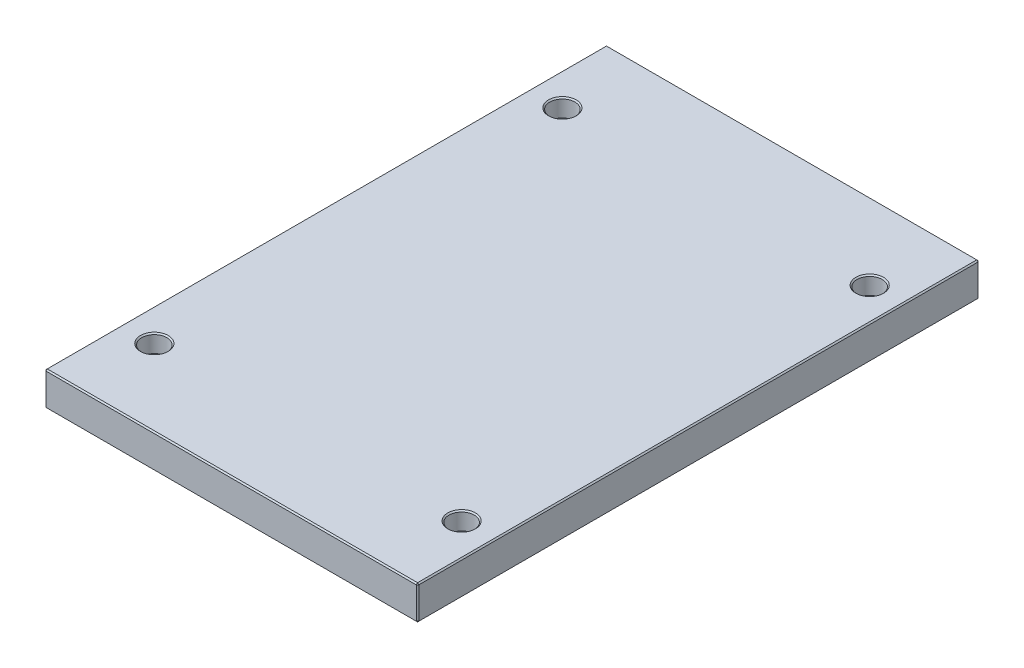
ISO-10303-21;
HEADER;
FILE_DESCRIPTION(('STEP AP214'),'2;1');
FILE_NAME('part.step','',(''),(''),'','','');
FILE_SCHEMA(('AUTOMOTIVE_DESIGN { 1 0 10303 214 1 1 1 1 }'));
ENDSEC;
DATA;
#1=APPLICATION_CONTEXT('core data for automotive mechanical design processes');
#2=APPLICATION_PROTOCOL_DEFINITION('international standard','automotive_design',2000,#1);
#3=PRODUCT_CONTEXT('',#1,'mechanical');
#4=PRODUCT('Part','Part','',(#3));
#5=PRODUCT_RELATED_PRODUCT_CATEGORY('part','',(#4));
#6=PRODUCT_DEFINITION_FORMATION('','',#4);
#7=PRODUCT_DEFINITION_CONTEXT('part definition',#1,'design');
#8=PRODUCT_DEFINITION('design','',#6,#7);
#9=PRODUCT_DEFINITION_SHAPE('','',#8);
#10=(LENGTH_UNIT() NAMED_UNIT(*) SI_UNIT(.MILLI.,.METRE.));
#11=(NAMED_UNIT(*) PLANE_ANGLE_UNIT() SI_UNIT($,.RADIAN.));
#12=(NAMED_UNIT(*) SI_UNIT($,.STERADIAN.) SOLID_ANGLE_UNIT());
#13=UNCERTAINTY_MEASURE_WITH_UNIT(LENGTH_MEASURE(1.E-05),#10,'distance_accuracy_value','');
#14=(GEOMETRIC_REPRESENTATION_CONTEXT(3) GLOBAL_UNCERTAINTY_ASSIGNED_CONTEXT((#13)) GLOBAL_UNIT_ASSIGNED_CONTEXT((#10,
#11,#12)) REPRESENTATION_CONTEXT('',''));
#15=CARTESIAN_POINT('',(0.,0.,0.));
#16=DIRECTION('',(0.,0.,1.));
#17=DIRECTION('',(1.,0.,0.));
#18=AXIS2_PLACEMENT_3D('',#15,#16,#17);
#19=CARTESIAN_POINT('',(-148.,27.,223.));
#20=DIRECTION('',(1.,0.,0.));
#21=DIRECTION('',(0.,0.,-1.));
#22=AXIS2_PLACEMENT_3D('',#19,#20,#21);
#23=PLANE('',#22);
#24=DIRECTION('',(0.,-1.,0.));
#25=VECTOR('',#24,1.);
#26=CARTESIAN_POINT('',(-148.,27.,-222.));
#27=LINE('',#26,#25);
#28=CARTESIAN_POINT('',(-148.,26.,-222.));
#29=VERTEX_POINT('',#28);
#30=CARTESIAN_POINT('',(-148.,1.,-222.));
#31=VERTEX_POINT('',#30);
#32=EDGE_CURVE('E115',#29,#31,#27,.T.);
#33=ORIENTED_EDGE('',*,*,#32,.T.);
#34=DIRECTION('',(0.,0.,1.));
#35=VECTOR('',#34,1.);
#36=CARTESIAN_POINT('',(-148.,1.,223.));
#37=LINE('',#36,#35);
#38=CARTESIAN_POINT('',(-148.,1.,222.));
#39=VERTEX_POINT('',#38);
#40=EDGE_CURVE('E111',#31,#39,#37,.T.);
#41=ORIENTED_EDGE('',*,*,#40,.T.);
#42=DIRECTION('',(0.,1.,0.));
#43=VECTOR('',#42,1.);
#44=CARTESIAN_POINT('',(-148.,27.,222.));
#45=LINE('',#44,#43);
#46=CARTESIAN_POINT('',(-148.,26.,222.));
#47=VERTEX_POINT('',#46);
#48=EDGE_CURVE('E104',#39,#47,#45,.T.);
#49=ORIENTED_EDGE('',*,*,#48,.T.);
#50=DIRECTION('',(0.,0.,-1.));
#51=VECTOR('',#50,1.);
#52=CARTESIAN_POINT('',(-148.,26.,-223.));
#53=LINE('',#52,#51);
#54=EDGE_CURVE('E108',#47,#29,#53,.T.);
#55=ORIENTED_EDGE('',*,*,#54,.T.);
#56=EDGE_LOOP('',(#33,#41,#49,#55));
#57=FACE_BOUND('',#56,.T.);
#58=ADVANCED_FACE('F16',(#57),#23,.F.);
#59=CARTESIAN_POINT('',(148.,27.,223.));
#60=DIRECTION('',(0.,0.,-1.));
#61=DIRECTION('',(-1.,0.,0.));
#62=AXIS2_PLACEMENT_3D('',#59,#60,#61);
#63=PLANE('',#62);
#64=DIRECTION('',(-1.,0.,0.));
#65=VECTOR('',#64,1.);
#66=CARTESIAN_POINT('',(-148.,26.,223.));
#67=LINE('',#66,#65);
#68=CARTESIAN_POINT('',(147.,26.,223.));
#69=VERTEX_POINT('',#68);
#70=CARTESIAN_POINT('',(-147.,26.,223.));
#71=VERTEX_POINT('',#70);
#72=EDGE_CURVE('E170',#69,#71,#67,.T.);
#73=ORIENTED_EDGE('',*,*,#72,.T.);
#74=DIRECTION('',(0.,-1.,0.));
#75=VECTOR('',#74,1.);
#76=CARTESIAN_POINT('',(-147.,27.,223.));
#77=LINE('',#76,#75);
#78=CARTESIAN_POINT('',(-147.,0.999999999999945,223.));
#79=VERTEX_POINT('',#78);
#80=EDGE_CURVE('E123',#71,#79,#77,.T.);
#81=ORIENTED_EDGE('',*,*,#80,.T.);
#82=DIRECTION('',(1.,0.,0.));
#83=VECTOR('',#82,1.);
#84=CARTESIAN_POINT('',(148.,0.999999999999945,223.));
#85=LINE('',#84,#83);
#86=CARTESIAN_POINT('',(147.,0.999999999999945,223.));
#87=VERTEX_POINT('',#86);
#88=EDGE_CURVE('E174',#79,#87,#85,.T.);
#89=ORIENTED_EDGE('',*,*,#88,.T.);
#90=DIRECTION('',(0.,1.,0.));
#91=VECTOR('',#90,1.);
#92=CARTESIAN_POINT('',(147.,27.,223.));
#93=LINE('',#92,#91);
#94=EDGE_CURVE('E172',#87,#69,#93,.T.);
#95=ORIENTED_EDGE('',*,*,#94,.T.);
#96=EDGE_LOOP('',(#73,#81,#89,#95));
#97=FACE_BOUND('',#96,.T.);
#98=ADVANCED_FACE('F317',(#97),#63,.F.);
#99=CARTESIAN_POINT('',(148.,27.,223.));
#100=DIRECTION('',(-1.,0.,0.));
#101=DIRECTION('',(0.,0.,1.));
#102=AXIS2_PLACEMENT_3D('',#99,#100,#101);
#103=PLANE('',#102);
#104=DIRECTION('',(0.,0.,-1.));
#105=VECTOR('',#104,1.);
#106=CARTESIAN_POINT('',(148.,0.999999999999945,223.));
#107=LINE('',#106,#105);
#108=CARTESIAN_POINT('',(148.,0.999999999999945,222.));
#109=VERTEX_POINT('',#108);
#110=CARTESIAN_POINT('',(148.,0.999999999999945,-222.));
#111=VERTEX_POINT('',#110);
#112=EDGE_CURVE('E165',#109,#111,#107,.T.);
#113=ORIENTED_EDGE('',*,*,#112,.T.);
#114=DIRECTION('',(0.,1.,0.));
#115=VECTOR('',#114,1.);
#116=CARTESIAN_POINT('',(148.,27.,-222.));
#117=LINE('',#116,#115);
#118=CARTESIAN_POINT('',(148.,26.,-222.));
#119=VERTEX_POINT('',#118);
#120=EDGE_CURVE('E167',#111,#119,#117,.T.);
#121=ORIENTED_EDGE('',*,*,#120,.T.);
#122=DIRECTION('',(0.,0.,1.));
#123=VECTOR('',#122,1.);
#124=CARTESIAN_POINT('',(148.,26.,223.));
#125=LINE('',#124,#123);
#126=CARTESIAN_POINT('',(148.,26.,222.));
#127=VERTEX_POINT('',#126);
#128=EDGE_CURVE('E161',#119,#127,#125,.T.);
#129=ORIENTED_EDGE('',*,*,#128,.T.);
#130=DIRECTION('',(0.,-1.,0.));
#131=VECTOR('',#130,1.);
#132=CARTESIAN_POINT('',(148.,27.,222.));
#133=LINE('',#132,#131);
#134=EDGE_CURVE('E163',#127,#109,#133,.T.);
#135=ORIENTED_EDGE('',*,*,#134,.T.);
#136=EDGE_LOOP('',(#113,#121,#129,#135));
#137=FACE_BOUND('',#136,.T.);
#138=ADVANCED_FACE('F323',(#137),#103,.F.);
#139=CARTESIAN_POINT('',(148.,27.,-223.));
#140=DIRECTION('',(0.,0.,1.));
#141=DIRECTION('',(1.,0.,0.));
#142=AXIS2_PLACEMENT_3D('',#139,#140,#141);
#143=PLANE('',#142);
#144=DIRECTION('',(0.,-1.,0.));
#145=VECTOR('',#144,1.);
#146=CARTESIAN_POINT('',(147.,27.,-223.));
#147=LINE('',#146,#145);
#148=CARTESIAN_POINT('',(147.,26.,-223.));
#149=VERTEX_POINT('',#148);
#150=CARTESIAN_POINT('',(147.,0.999999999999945,-223.));
#151=VERTEX_POINT('',#150);
#152=EDGE_CURVE('E154',#149,#151,#147,.T.);
#153=ORIENTED_EDGE('',*,*,#152,.T.);
#154=DIRECTION('',(-1.,0.,0.));
#155=VECTOR('',#154,1.);
#156=CARTESIAN_POINT('',(148.,0.999999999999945,-223.));
#157=LINE('',#156,#155);
#158=CARTESIAN_POINT('',(-147.,0.999999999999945,-223.));
#159=VERTEX_POINT('',#158);
#160=EDGE_CURVE('E159',#151,#159,#157,.T.);
#161=ORIENTED_EDGE('',*,*,#160,.T.);
#162=DIRECTION('',(0.,1.,0.));
#163=VECTOR('',#162,1.);
#164=CARTESIAN_POINT('',(-147.,27.,-223.));
#165=LINE('',#164,#163);
#166=CARTESIAN_POINT('',(-147.,26.,-223.));
#167=VERTEX_POINT('',#166);
#168=EDGE_CURVE('E156',#159,#167,#165,.T.);
#169=ORIENTED_EDGE('',*,*,#168,.T.);
#170=DIRECTION('',(1.,0.,0.));
#171=VECTOR('',#170,1.);
#172=CARTESIAN_POINT('',(148.,26.,-223.));
#173=LINE('',#172,#171);
#174=EDGE_CURVE('E152',#167,#149,#173,.T.);
#175=ORIENTED_EDGE('',*,*,#174,.T.);
#176=EDGE_LOOP('',(#153,#161,#169,#175));
#177=FACE_BOUND('',#176,.T.);
#178=ADVANCED_FACE('F465',(#177),#143,.F.);
#179=CARTESIAN_POINT('',(0.,27.,0.));
#180=DIRECTION('',(0.,1.,0.));
#181=DIRECTION('',(0.,0.,1.));
#182=AXIS2_PLACEMENT_3D('',#179,#180,#181);
#183=PLANE('',#182);
#184=CARTESIAN_POINT('',(-122.,27.,162.));
#185=DIRECTION('',(0.,1.,0.));
#186=DIRECTION('',(0.,0.,1.));
#187=AXIS2_PLACEMENT_3D('',#184,#185,#186);
#188=CIRCLE('',#187,11.);
#189=CARTESIAN_POINT('',(-122.,27.,173.));
#190=VERTEX_POINT('',#189);
#191=EDGE_CURVE('E290',#190,#190,#188,.F.);
#192=ORIENTED_EDGE('',*,*,#191,.T.);
#193=EDGE_LOOP('',(#192));
#194=FACE_BOUND('',#193,.T.);
#195=CARTESIAN_POINT('',(122.,27.,162.));
#196=DIRECTION('',(0.,1.,0.));
#197=DIRECTION('',(0.,0.,1.));
#198=AXIS2_PLACEMENT_3D('',#195,#196,#197);
#199=CIRCLE('',#198,11.);
#200=CARTESIAN_POINT('',(122.,27.,173.));
#201=VERTEX_POINT('',#200);
#202=EDGE_CURVE('E287',#201,#201,#199,.F.);
#203=ORIENTED_EDGE('',*,*,#202,.T.);
#204=EDGE_LOOP('',(#203));
#205=FACE_BOUND('',#204,.T.);
#206=CARTESIAN_POINT('',(122.,27.,-162.));
#207=DIRECTION('',(0.,1.,0.));
#208=DIRECTION('',(0.,0.,1.));
#209=AXIS2_PLACEMENT_3D('',#206,#207,#208);
#210=CIRCLE('',#209,11.);
#211=CARTESIAN_POINT('',(122.,27.,-151.));
#212=VERTEX_POINT('',#211);
#213=EDGE_CURVE('E284',#212,#212,#210,.F.);
#214=ORIENTED_EDGE('',*,*,#213,.T.);
#215=EDGE_LOOP('',(#214));
#216=FACE_BOUND('',#215,.T.);
#217=CARTESIAN_POINT('',(-122.,27.,-162.));
#218=DIRECTION('',(0.,1.,0.));
#219=DIRECTION('',(0.,0.,1.));
#220=AXIS2_PLACEMENT_3D('',#217,#218,#219);
#221=CIRCLE('',#220,11.);
#222=CARTESIAN_POINT('',(-122.,27.,-151.));
#223=VERTEX_POINT('',#222);
#224=EDGE_CURVE('E281',#223,#223,#221,.F.);
#225=ORIENTED_EDGE('',*,*,#224,.T.);
#226=EDGE_LOOP('',(#225));
#227=FACE_BOUND('',#226,.T.);
#228=DIRECTION('',(0.,0.,-1.));
#229=VECTOR('',#228,1.);
#230=CARTESIAN_POINT('',(147.,27.,-223.));
#231=LINE('',#230,#229);
#232=CARTESIAN_POINT('',(147.,27.,222.));
#233=VERTEX_POINT('',#232);
#234=CARTESIAN_POINT('',(147.,27.,-222.));
#235=VERTEX_POINT('',#234);
#236=EDGE_CURVE('E31',#233,#235,#231,.T.);
#237=ORIENTED_EDGE('',*,*,#236,.T.);
#238=DIRECTION('',(-1.,0.,0.));
#239=VECTOR('',#238,1.);
#240=CARTESIAN_POINT('',(-148.,27.,-222.));
#241=LINE('',#240,#239);
#242=CARTESIAN_POINT('',(-147.,27.,-222.));
#243=VERTEX_POINT('',#242);
#244=EDGE_CURVE('E190',#235,#243,#241,.T.);
#245=ORIENTED_EDGE('',*,*,#244,.T.);
#246=DIRECTION('',(0.,0.,1.));
#247=VECTOR('',#246,1.);
#248=CARTESIAN_POINT('',(-147.,27.,223.));
#249=LINE('',#248,#247);
#250=CARTESIAN_POINT('',(-147.,27.,222.));
#251=VERTEX_POINT('',#250);
#252=EDGE_CURVE('E186',#243,#251,#249,.T.);
#253=ORIENTED_EDGE('',*,*,#252,.T.);
#254=DIRECTION('',(1.,0.,0.));
#255=VECTOR('',#254,1.);
#256=CARTESIAN_POINT('',(148.,27.,222.));
#257=LINE('',#256,#255);
#258=EDGE_CURVE('E36',#251,#233,#257,.T.);
#259=ORIENTED_EDGE('',*,*,#258,.T.);
#260=EDGE_LOOP('',(#237,#245,#253,#259));
#261=FACE_BOUND('',#260,.T.);
#262=ADVANCED_FACE('F462',(#194,#205,#216,#227,#261),#183,.T.);
#263=CARTESIAN_POINT('',(0.,0.,0.));
#264=DIRECTION('',(0.,1.,0.));
#265=DIRECTION('',(0.,0.,1.));
#266=AXIS2_PLACEMENT_3D('',#263,#264,#265);
#267=PLANE('',#266);
#268=CARTESIAN_POINT('',(122.,0.,-162.));
#269=DIRECTION('',(0.,1.,0.));
#270=DIRECTION('',(0.,0.,1.));
#271=AXIS2_PLACEMENT_3D('',#268,#269,#270);
#272=CIRCLE('',#271,7.9999999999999);
#273=CARTESIAN_POINT('',(122.,0.,-154.));
#274=VERTEX_POINT('',#273);
#275=EDGE_CURVE('E263',#274,#274,#272,.T.);
#276=ORIENTED_EDGE('',*,*,#275,.T.);
#277=EDGE_LOOP('',(#276));
#278=FACE_BOUND('',#277,.T.);
#279=CARTESIAN_POINT('',(122.,0.,162.));
#280=DIRECTION('',(0.,1.,0.));
#281=DIRECTION('',(0.,0.,1.));
#282=AXIS2_PLACEMENT_3D('',#279,#280,#281);
#283=CIRCLE('',#282,7.9999999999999);
#284=CARTESIAN_POINT('',(122.,0.,170.));
#285=VERTEX_POINT('',#284);
#286=EDGE_CURVE('E260',#285,#285,#283,.T.);
#287=ORIENTED_EDGE('',*,*,#286,.T.);
#288=EDGE_LOOP('',(#287));
#289=FACE_BOUND('',#288,.T.);
#290=CARTESIAN_POINT('',(-122.,0.,162.));
#291=DIRECTION('',(0.,1.,0.));
#292=DIRECTION('',(0.,0.,1.));
#293=AXIS2_PLACEMENT_3D('',#290,#291,#292);
#294=CIRCLE('',#293,7.9999999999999);
#295=CARTESIAN_POINT('',(-122.,0.,170.));
#296=VERTEX_POINT('',#295);
#297=EDGE_CURVE('E257',#296,#296,#294,.T.);
#298=ORIENTED_EDGE('',*,*,#297,.T.);
#299=EDGE_LOOP('',(#298));
#300=FACE_BOUND('',#299,.T.);
#301=CARTESIAN_POINT('',(-122.,0.,-162.));
#302=DIRECTION('',(0.,1.,0.));
#303=DIRECTION('',(0.,0.,1.));
#304=AXIS2_PLACEMENT_3D('',#301,#302,#303);
#305=CIRCLE('',#304,7.9999999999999);
#306=CARTESIAN_POINT('',(-122.,0.,-154.));
#307=VERTEX_POINT('',#306);
#308=EDGE_CURVE('E192',#307,#307,#305,.T.);
#309=ORIENTED_EDGE('',*,*,#308,.T.);
#310=EDGE_LOOP('',(#309));
#311=FACE_BOUND('',#310,.T.);
#312=DIRECTION('',(0.,0.,1.));
#313=VECTOR('',#312,1.);
#314=CARTESIAN_POINT('',(147.,0.,0.));
#315=LINE('',#314,#313);
#316=CARTESIAN_POINT('',(147.,0.,-222.));
#317=VERTEX_POINT('',#316);
#318=CARTESIAN_POINT('',(147.,0.,222.));
#319=VERTEX_POINT('',#318);
#320=EDGE_CURVE('E177',#317,#319,#315,.T.);
#321=ORIENTED_EDGE('',*,*,#320,.T.);
#322=DIRECTION('',(-1.,0.,0.));
#323=VECTOR('',#322,1.);
#324=CARTESIAN_POINT('',(0.,0.,222.));
#325=LINE('',#324,#323);
#326=CARTESIAN_POINT('',(-147.,0.,222.));
#327=VERTEX_POINT('',#326);
#328=EDGE_CURVE('E183',#319,#327,#325,.T.);
#329=ORIENTED_EDGE('',*,*,#328,.T.);
#330=DIRECTION('',(0.,0.,-1.));
#331=VECTOR('',#330,1.);
#332=CARTESIAN_POINT('',(-147.,0.,0.));
#333=LINE('',#332,#331);
#334=CARTESIAN_POINT('',(-147.,0.,-222.));
#335=VERTEX_POINT('',#334);
#336=EDGE_CURVE('E181',#327,#335,#333,.T.);
#337=ORIENTED_EDGE('',*,*,#336,.T.);
#338=DIRECTION('',(1.,0.,0.));
#339=VECTOR('',#338,1.);
#340=CARTESIAN_POINT('',(0.,0.,-222.));
#341=LINE('',#340,#339);
#342=EDGE_CURVE('E179',#335,#317,#341,.T.);
#343=ORIENTED_EDGE('',*,*,#342,.T.);
#344=EDGE_LOOP('',(#321,#329,#337,#343));
#345=FACE_BOUND('',#344,.T.);
#346=ADVANCED_FACE('F402',(#278,#289,#300,#311,#345),#267,.F.);
#347=CARTESIAN_POINT('',(148.,27.,222.));
#348=DIRECTION('',(-0.707106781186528,0.,-0.707106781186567));
#349=DIRECTION('',(0.,-1.,0.));
#350=AXIS2_PLACEMENT_3D('',#347,#348,#349);
#351=PLANE('',#350);
#352=DIRECTION('',(-0.707106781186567,0.,0.707106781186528));
#353=VECTOR('',#352,1.);
#354=CARTESIAN_POINT('',(147.,26.,223.));
#355=LINE('',#354,#353);
#356=EDGE_CURVE('E141',#69,#127,#355,.F.);
#357=ORIENTED_EDGE('',*,*,#356,.F.);
#358=ORIENTED_EDGE('',*,*,#94,.F.);
#359=DIRECTION('',(0.707106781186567,0.,-0.707106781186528));
#360=VECTOR('',#359,1.);
#361=CARTESIAN_POINT('',(147.,0.999999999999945,223.));
#362=LINE('',#361,#360);
#363=EDGE_CURVE('E144',#109,#87,#362,.F.);
#364=ORIENTED_EDGE('',*,*,#363,.F.);
#365=ORIENTED_EDGE('',*,*,#134,.F.);
#366=EDGE_LOOP('',(#357,#358,#364,#365));
#367=FACE_BOUND('',#366,.T.);
#368=ADVANCED_FACE('F398',(#367),#351,.F.);
#369=CARTESIAN_POINT('',(147.,26.,223.));
#370=DIRECTION('',(0.577350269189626,0.577350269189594,0.577350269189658));
#371=DIRECTION('',(0.707106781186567,0.,-0.707106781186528));
#372=AXIS2_PLACEMENT_3D('',#369,#370,#371);
#373=PLANE('',#372);
#374=DIRECTION('',(0.,-0.707106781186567,0.707106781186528));
#375=VECTOR('',#374,1.);
#376=CARTESIAN_POINT('',(147.,26.,223.));
#377=LINE('',#376,#375);
#378=EDGE_CURVE('E235',#69,#233,#377,.F.);
#379=ORIENTED_EDGE('',*,*,#378,.F.);
#380=ORIENTED_EDGE('',*,*,#356,.T.);
#381=DIRECTION('',(-0.707106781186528,0.707106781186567,0.));
#382=VECTOR('',#381,1.);
#383=CARTESIAN_POINT('',(147.5,26.5,222.));
#384=LINE('',#383,#382);
#385=EDGE_CURVE('E237',#233,#127,#384,.F.);
#386=ORIENTED_EDGE('',*,*,#385,.F.);
#387=EDGE_LOOP('',(#379,#380,#386));
#388=FACE_BOUND('',#387,.T.);
#389=ADVANCED_FACE('F394',(#388),#373,.T.);
#390=CARTESIAN_POINT('',(147.,0.999999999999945,223.));
#391=DIRECTION('',(0.577350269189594,-0.577350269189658,0.577350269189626));
#392=DIRECTION('',(0.,-0.707106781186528,-0.707106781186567));
#393=AXIS2_PLACEMENT_3D('',#390,#391,#392);
#394=PLANE('',#393);
#395=DIRECTION('',(-0.707106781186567,-0.707106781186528,0.));
#396=VECTOR('',#395,1.);
#397=CARTESIAN_POINT('',(147.5,0.499999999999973,222.));
#398=LINE('',#397,#396);
#399=EDGE_CURVE('E229',#109,#319,#398,.T.);
#400=ORIENTED_EDGE('',*,*,#399,.F.);
#401=ORIENTED_EDGE('',*,*,#363,.T.);
#402=DIRECTION('',(0.,0.707106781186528,0.707106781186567));
#403=VECTOR('',#402,1.);
#404=CARTESIAN_POINT('',(147.,0.999999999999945,223.));
#405=LINE('',#404,#403);
#406=EDGE_CURVE('E232',#319,#87,#405,.T.);
#407=ORIENTED_EDGE('',*,*,#406,.F.);
#408=EDGE_LOOP('',(#400,#401,#407));
#409=FACE_BOUND('',#408,.T.);
#410=ADVANCED_FACE('F390',(#409),#394,.T.);
#411=CARTESIAN_POINT('',(147.,27.,0.));
#412=DIRECTION('',(0.707106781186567,0.707106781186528,0.));
#413=DIRECTION('',(0.,0.,1.));
#414=AXIS2_PLACEMENT_3D('',#411,#412,#413);
#415=PLANE('',#414);
#416=ORIENTED_EDGE('',*,*,#385,.T.);
#417=ORIENTED_EDGE('',*,*,#128,.F.);
#418=DIRECTION('',(0.707106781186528,-0.707106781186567,0.));
#419=VECTOR('',#418,1.);
#420=CARTESIAN_POINT('',(148.,26.,-222.));
#421=LINE('',#420,#419);
#422=EDGE_CURVE('E224',#235,#119,#421,.T.);
#423=ORIENTED_EDGE('',*,*,#422,.F.);
#424=ORIENTED_EDGE('',*,*,#236,.F.);
#425=EDGE_LOOP('',(#416,#417,#423,#424));
#426=FACE_BOUND('',#425,.T.);
#427=ADVANCED_FACE('F386',(#426),#415,.T.);
#428=CARTESIAN_POINT('',(0.,27.,222.));
#429=DIRECTION('',(0.,0.707106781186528,0.707106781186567));
#430=DIRECTION('',(-1.,0.,0.));
#431=AXIS2_PLACEMENT_3D('',#428,#429,#430);
#432=PLANE('',#431);
#433=ORIENTED_EDGE('',*,*,#378,.T.);
#434=ORIENTED_EDGE('',*,*,#258,.F.);
#435=DIRECTION('',(0.,0.707106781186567,-0.707106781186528));
#436=VECTOR('',#435,1.);
#437=CARTESIAN_POINT('',(-147.,26.5,222.5));
#438=LINE('',#437,#436);
#439=EDGE_CURVE('E127',#71,#251,#438,.T.);
#440=ORIENTED_EDGE('',*,*,#439,.F.);
#441=ORIENTED_EDGE('',*,*,#72,.F.);
#442=EDGE_LOOP('',(#433,#434,#440,#441));
#443=FACE_BOUND('',#442,.T.);
#444=ADVANCED_FACE('F383',(#443),#432,.T.);
#445=CARTESIAN_POINT('',(-147.,27.,223.));
#446=DIRECTION('',(0.707106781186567,0.,-0.707106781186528));
#447=DIRECTION('',(0.,-1.,0.));
#448=AXIS2_PLACEMENT_3D('',#445,#446,#447);
#449=PLANE('',#448);
#450=DIRECTION('',(0.707106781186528,0.,0.707106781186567));
#451=VECTOR('',#450,1.);
#452=CARTESIAN_POINT('',(-147.,0.999999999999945,223.));
#453=LINE('',#452,#451);
#454=EDGE_CURVE('E128',#79,#39,#453,.F.);
#455=ORIENTED_EDGE('',*,*,#454,.F.);
#456=ORIENTED_EDGE('',*,*,#80,.F.);
#457=DIRECTION('',(-0.707106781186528,0.,-0.707106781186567));
#458=VECTOR('',#457,1.);
#459=CARTESIAN_POINT('',(-148.,26.,222.));
#460=LINE('',#459,#458);
#461=EDGE_CURVE('E119',#47,#71,#460,.F.);
#462=ORIENTED_EDGE('',*,*,#461,.F.);
#463=ORIENTED_EDGE('',*,*,#48,.F.);
#464=EDGE_LOOP('',(#455,#456,#462,#463));
#465=FACE_BOUND('',#464,.T.);
#466=ADVANCED_FACE('F121',(#465),#449,.F.);
#467=CARTESIAN_POINT('',(148.,0.999999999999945,223.));
#468=DIRECTION('',(0.,0.707106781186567,-0.707106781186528));
#469=DIRECTION('',(1.,0.,0.));
#470=AXIS2_PLACEMENT_3D('',#467,#468,#469);
#471=PLANE('',#470);
#472=ORIENTED_EDGE('',*,*,#406,.T.);
#473=ORIENTED_EDGE('',*,*,#88,.F.);
#474=DIRECTION('',(0.,-0.707106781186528,-0.707106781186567));
#475=VECTOR('',#474,1.);
#476=CARTESIAN_POINT('',(-147.,0.999999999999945,223.));
#477=LINE('',#476,#475);
#478=EDGE_CURVE('E220',#327,#79,#477,.F.);
#479=ORIENTED_EDGE('',*,*,#478,.F.);
#480=ORIENTED_EDGE('',*,*,#328,.F.);
#481=EDGE_LOOP('',(#472,#473,#479,#480));
#482=FACE_BOUND('',#481,.T.);
#483=ADVANCED_FACE('F376',(#482),#471,.F.);
#484=CARTESIAN_POINT('',(148.,0.999999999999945,223.));
#485=DIRECTION('',(-0.707106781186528,0.707106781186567,0.));
#486=DIRECTION('',(0.,0.,-1.));
#487=AXIS2_PLACEMENT_3D('',#484,#485,#486);
#488=PLANE('',#487);
#489=ORIENTED_EDGE('',*,*,#399,.T.);
#490=ORIENTED_EDGE('',*,*,#320,.F.);
#491=DIRECTION('',(0.707106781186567,0.707106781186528,0.));
#492=VECTOR('',#491,1.);
#493=CARTESIAN_POINT('',(147.5,0.499999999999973,-222.));
#494=LINE('',#493,#492);
#495=EDGE_CURVE('E217',#111,#317,#494,.F.);
#496=ORIENTED_EDGE('',*,*,#495,.F.);
#497=ORIENTED_EDGE('',*,*,#112,.F.);
#498=EDGE_LOOP('',(#489,#490,#496,#497));
#499=FACE_BOUND('',#498,.T.);
#500=ADVANCED_FACE('F372',(#499),#488,.F.);
#501=CARTESIAN_POINT('',(147.,27.,-223.));
#502=DIRECTION('',(-0.707106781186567,0.,0.707106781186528));
#503=DIRECTION('',(0.,-1.,0.));
#504=AXIS2_PLACEMENT_3D('',#501,#502,#503);
#505=PLANE('',#504);
#506=DIRECTION('',(0.707106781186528,0.,0.707106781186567));
#507=VECTOR('',#506,1.);
#508=CARTESIAN_POINT('',(148.,26.,-222.));
#509=LINE('',#508,#507);
#510=EDGE_CURVE('E226',#119,#149,#509,.F.);
#511=ORIENTED_EDGE('',*,*,#510,.F.);
#512=ORIENTED_EDGE('',*,*,#120,.F.);
#513=DIRECTION('',(-0.707106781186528,0.,-0.707106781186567));
#514=VECTOR('',#513,1.);
#515=CARTESIAN_POINT('',(147.,0.999999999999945,-223.));
#516=LINE('',#515,#514);
#517=EDGE_CURVE('E214',#151,#111,#516,.F.);
#518=ORIENTED_EDGE('',*,*,#517,.F.);
#519=ORIENTED_EDGE('',*,*,#152,.F.);
#520=EDGE_LOOP('',(#511,#512,#518,#519));
#521=FACE_BOUND('',#520,.T.);
#522=ADVANCED_FACE('F368',(#521),#505,.F.);
#523=CARTESIAN_POINT('',(148.,26.,-222.));
#524=DIRECTION('',(0.577350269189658,0.577350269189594,-0.577350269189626));
#525=DIRECTION('',(-0.707106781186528,0.,-0.707106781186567));
#526=AXIS2_PLACEMENT_3D('',#523,#524,#525);
#527=PLANE('',#526);
#528=ORIENTED_EDGE('',*,*,#422,.T.);
#529=ORIENTED_EDGE('',*,*,#510,.T.);
#530=DIRECTION('',(0.,0.707106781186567,0.707106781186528));
#531=VECTOR('',#530,1.);
#532=CARTESIAN_POINT('',(147.,26.5,-222.5));
#533=LINE('',#532,#531);
#534=EDGE_CURVE('E135',#235,#149,#533,.F.);
#535=ORIENTED_EDGE('',*,*,#534,.F.);
#536=EDGE_LOOP('',(#528,#529,#535));
#537=FACE_BOUND('',#536,.T.);
#538=ADVANCED_FACE('F365',(#537),#527,.T.);
#539=CARTESIAN_POINT('',(-148.,26.,222.));
#540=DIRECTION('',(-0.577350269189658,0.577350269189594,0.577350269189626));
#541=DIRECTION('',(0.707106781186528,0.,0.707106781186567));
#542=AXIS2_PLACEMENT_3D('',#539,#540,#541);
#543=PLANE('',#542);
#544=ORIENTED_EDGE('',*,*,#461,.T.);
#545=ORIENTED_EDGE('',*,*,#439,.T.);
#546=DIRECTION('',(-0.707106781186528,-0.707106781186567,0.));
#547=VECTOR('',#546,1.);
#548=CARTESIAN_POINT('',(-148.,26.,222.));
#549=LINE('',#548,#547);
#550=EDGE_CURVE('E131',#47,#251,#549,.F.);
#551=ORIENTED_EDGE('',*,*,#550,.F.);
#552=EDGE_LOOP('',(#544,#545,#551));
#553=FACE_BOUND('',#552,.T.);
#554=ADVANCED_FACE('F132',(#553),#543,.T.);
#555=CARTESIAN_POINT('',(-147.,0.999999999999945,223.));
#556=DIRECTION('',(-0.577350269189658,-0.577350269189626,0.577350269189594));
#557=DIRECTION('',(0.707106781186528,-0.707106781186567,0.));
#558=AXIS2_PLACEMENT_3D('',#555,#556,#557);
#559=PLANE('',#558);
#560=ORIENTED_EDGE('',*,*,#478,.T.);
#561=ORIENTED_EDGE('',*,*,#454,.T.);
#562=DIRECTION('',(-0.707106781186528,0.707106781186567,0.));
#563=VECTOR('',#562,1.);
#564=CARTESIAN_POINT('',(-147.5,0.5,222.));
#565=LINE('',#564,#563);
#566=EDGE_CURVE('E136',#327,#39,#565,.T.);
#567=ORIENTED_EDGE('',*,*,#566,.F.);
#568=EDGE_LOOP('',(#560,#561,#567));
#569=FACE_BOUND('',#568,.T.);
#570=ADVANCED_FACE('F358',(#569),#559,.T.);
#571=CARTESIAN_POINT('',(147.,0.999999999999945,-223.));
#572=DIRECTION('',(0.577350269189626,-0.577350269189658,-0.577350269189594));
#573=DIRECTION('',(0.707106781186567,0.707106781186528,0.));
#574=AXIS2_PLACEMENT_3D('',#571,#572,#573);
#575=PLANE('',#574);
#576=ORIENTED_EDGE('',*,*,#517,.T.);
#577=ORIENTED_EDGE('',*,*,#495,.T.);
#578=DIRECTION('',(0.,-0.707106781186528,0.707106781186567));
#579=VECTOR('',#578,1.);
#580=CARTESIAN_POINT('',(147.,0.999999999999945,-223.));
#581=LINE('',#580,#579);
#582=EDGE_CURVE('E207',#151,#317,#581,.T.);
#583=ORIENTED_EDGE('',*,*,#582,.F.);
#584=EDGE_LOOP('',(#576,#577,#583));
#585=FACE_BOUND('',#584,.T.);
#586=ADVANCED_FACE('F354',(#585),#575,.T.);
#587=CARTESIAN_POINT('',(0.,27.,-222.));
#588=DIRECTION('',(0.,0.707106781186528,-0.707106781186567));
#589=DIRECTION('',(1.,0.,0.));
#590=AXIS2_PLACEMENT_3D('',#587,#588,#589);
#591=PLANE('',#590);
#592=ORIENTED_EDGE('',*,*,#534,.T.);
#593=ORIENTED_EDGE('',*,*,#174,.F.);
#594=DIRECTION('',(0.,-0.707106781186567,-0.707106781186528));
#595=VECTOR('',#594,1.);
#596=CARTESIAN_POINT('',(-147.,26.,-223.));
#597=LINE('',#596,#595);
#598=EDGE_CURVE('E204',#243,#167,#597,.T.);
#599=ORIENTED_EDGE('',*,*,#598,.F.);
#600=ORIENTED_EDGE('',*,*,#244,.F.);
#601=EDGE_LOOP('',(#592,#593,#599,#600));
#602=FACE_BOUND('',#601,.T.);
#603=ADVANCED_FACE('F351',(#602),#591,.T.);
#604=CARTESIAN_POINT('',(-147.,27.,0.));
#605=DIRECTION('',(-0.707106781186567,0.707106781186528,0.));
#606=DIRECTION('',(0.,0.,-1.));
#607=AXIS2_PLACEMENT_3D('',#604,#605,#606);
#608=PLANE('',#607);
#609=ORIENTED_EDGE('',*,*,#550,.T.);
#610=ORIENTED_EDGE('',*,*,#252,.F.);
#611=DIRECTION('',(0.707106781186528,0.707106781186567,0.));
#612=VECTOR('',#611,1.);
#613=CARTESIAN_POINT('',(-147.5,26.5,-222.));
#614=LINE('',#613,#612);
#615=EDGE_CURVE('E139',#29,#243,#614,.T.);
#616=ORIENTED_EDGE('',*,*,#615,.F.);
#617=ORIENTED_EDGE('',*,*,#54,.F.);
#618=EDGE_LOOP('',(#609,#610,#616,#617));
#619=FACE_BOUND('',#618,.T.);
#620=ADVANCED_FACE('F138',(#619),#608,.T.);
#621=CARTESIAN_POINT('',(-148.,1.,223.));
#622=DIRECTION('',(0.707106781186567,0.707106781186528,0.));
#623=DIRECTION('',(0.,0.,1.));
#624=AXIS2_PLACEMENT_3D('',#621,#622,#623);
#625=PLANE('',#624);
#626=ORIENTED_EDGE('',*,*,#566,.T.);
#627=ORIENTED_EDGE('',*,*,#40,.F.);
#628=DIRECTION('',(0.707106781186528,-0.707106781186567,0.));
#629=VECTOR('',#628,1.);
#630=CARTESIAN_POINT('',(-148.,1.,-222.));
#631=LINE('',#630,#629);
#632=EDGE_CURVE('E200',#335,#31,#631,.F.);
#633=ORIENTED_EDGE('',*,*,#632,.F.);
#634=ORIENTED_EDGE('',*,*,#336,.F.);
#635=EDGE_LOOP('',(#626,#627,#633,#634));
#636=FACE_BOUND('',#635,.T.);
#637=ADVANCED_FACE('F344',(#636),#625,.F.);
#638=CARTESIAN_POINT('',(148.,0.999999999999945,-223.));
#639=DIRECTION('',(0.,0.707106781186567,0.707106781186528));
#640=DIRECTION('',(-1.,0.,0.));
#641=AXIS2_PLACEMENT_3D('',#638,#639,#640);
#642=PLANE('',#641);
#643=ORIENTED_EDGE('',*,*,#582,.T.);
#644=ORIENTED_EDGE('',*,*,#342,.F.);
#645=DIRECTION('',(0.,0.707106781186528,-0.707106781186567));
#646=VECTOR('',#645,1.);
#647=CARTESIAN_POINT('',(-147.,0.499999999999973,-222.5));
#648=LINE('',#647,#646);
#649=EDGE_CURVE('E197',#159,#335,#648,.F.);
#650=ORIENTED_EDGE('',*,*,#649,.F.);
#651=ORIENTED_EDGE('',*,*,#160,.F.);
#652=EDGE_LOOP('',(#643,#644,#650,#651));
#653=FACE_BOUND('',#652,.T.);
#654=ADVANCED_FACE('F340',(#653),#642,.F.);
#655=CARTESIAN_POINT('',(-147.,26.,-223.));
#656=DIRECTION('',(-0.577350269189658,0.577350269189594,-0.577350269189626));
#657=DIRECTION('',(-0.707106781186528,0.,0.707106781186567));
#658=AXIS2_PLACEMENT_3D('',#655,#656,#657);
#659=PLANE('',#658);
#660=ORIENTED_EDGE('',*,*,#615,.T.);
#661=ORIENTED_EDGE('',*,*,#598,.T.);
#662=DIRECTION('',(0.707106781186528,0.,-0.707106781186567));
#663=VECTOR('',#662,1.);
#664=CARTESIAN_POINT('',(-147.,26.,-223.));
#665=LINE('',#664,#663);
#666=EDGE_CURVE('E195',#29,#167,#665,.T.);
#667=ORIENTED_EDGE('',*,*,#666,.F.);
#668=EDGE_LOOP('',(#660,#661,#667));
#669=FACE_BOUND('',#668,.T.);
#670=ADVANCED_FACE('F336',(#669),#659,.T.);
#671=CARTESIAN_POINT('',(-148.,1.,-222.));
#672=DIRECTION('',(-0.577350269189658,-0.577350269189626,-0.577350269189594));
#673=DIRECTION('',(0.707106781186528,-0.707106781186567,0.));
#674=AXIS2_PLACEMENT_3D('',#671,#672,#673);
#675=PLANE('',#674);
#676=ORIENTED_EDGE('',*,*,#649,.T.);
#677=ORIENTED_EDGE('',*,*,#632,.T.);
#678=DIRECTION('',(-0.707106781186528,0.,0.707106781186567));
#679=VECTOR('',#678,1.);
#680=CARTESIAN_POINT('',(-148.,1.,-222.));
#681=LINE('',#680,#679);
#682=EDGE_CURVE('E193',#159,#31,#681,.T.);
#683=ORIENTED_EDGE('',*,*,#682,.F.);
#684=EDGE_LOOP('',(#676,#677,#683));
#685=FACE_BOUND('',#684,.T.);
#686=ADVANCED_FACE('F332',(#685),#675,.T.);
#687=CARTESIAN_POINT('',(-148.,27.,-222.));
#688=DIRECTION('',(0.707106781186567,0.,0.707106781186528));
#689=DIRECTION('',(0.,-1.,0.));
#690=AXIS2_PLACEMENT_3D('',#687,#688,#689);
#691=PLANE('',#690);
#692=ORIENTED_EDGE('',*,*,#666,.T.);
#693=ORIENTED_EDGE('',*,*,#168,.F.);
#694=ORIENTED_EDGE('',*,*,#682,.T.);
#695=ORIENTED_EDGE('',*,*,#32,.F.);
#696=EDGE_LOOP('',(#692,#693,#694,#695));
#697=FACE_BOUND('',#696,.T.);
#698=ADVANCED_FACE('F328',(#697),#691,.F.);
#699=CARTESIAN_POINT('',(-122.,13.,-162.));
#700=DIRECTION('',(0.,1.,0.));
#701=DIRECTION('',(0.,0.,1.));
#702=AXIS2_PLACEMENT_3D('',#699,#700,#701);
#703=CYLINDRICAL_SURFACE('',#702,10.);
#704=CARTESIAN_POINT('',(-122.,26.,-162.));
#705=DIRECTION('',(0.,1.,0.));
#706=DIRECTION('',(0.,0.,1.));
#707=AXIS2_PLACEMENT_3D('',#704,#705,#706);
#708=CIRCLE('',#707,10.);
#709=CARTESIAN_POINT('',(-122.,26.,-152.));
#710=VERTEX_POINT('',#709);
#711=EDGE_CURVE('E10',#710,#710,#708,.T.);
#712=ORIENTED_EDGE('',*,*,#711,.T.);
#713=EDGE_LOOP('',(#712));
#714=FACE_BOUND('',#713,.T.);
#715=CARTESIAN_POINT('',(-122.,13.,-162.));
#716=DIRECTION('',(0.,1.,0.));
#717=DIRECTION('',(0.,0.,1.));
#718=AXIS2_PLACEMENT_3D('',#715,#716,#717);
#719=CIRCLE('',#718,10.);
#720=CARTESIAN_POINT('',(-122.,13.,-152.));
#721=VERTEX_POINT('',#720);
#722=EDGE_CURVE('E147',#721,#721,#719,.T.);
#723=ORIENTED_EDGE('',*,*,#722,.F.);
#724=EDGE_LOOP('',(#723));
#725=FACE_BOUND('',#724,.T.);
#726=ADVANCED_FACE('F331',(#714,#725),#703,.F.);
#727=CARTESIAN_POINT('',(-122.,13.,-162.));
#728=DIRECTION('',(0.,1.,0.));
#729=DIRECTION('',(0.,0.,1.));
#730=AXIS2_PLACEMENT_3D('',#727,#728,#729);
#731=PLANE('',#730);
#732=CARTESIAN_POINT('',(-122.,13.,-162.));
#733=DIRECTION('',(0.,1.,0.));
#734=DIRECTION('',(0.,0.,1.));
#735=AXIS2_PLACEMENT_3D('',#732,#733,#734);
#736=CIRCLE('',#735,7.);
#737=CARTESIAN_POINT('',(-122.,13.,-155.));
#738=VERTEX_POINT('',#737);
#739=EDGE_CURVE('E251',#738,#738,#736,.T.);
#740=ORIENTED_EDGE('',*,*,#739,.F.);
#741=EDGE_LOOP('',(#740));
#742=FACE_BOUND('',#741,.T.);
#743=ORIENTED_EDGE('',*,*,#722,.T.);
#744=EDGE_LOOP('',(#743));
#745=FACE_BOUND('',#744,.T.);
#746=ADVANCED_FACE('F450',(#742,#745),#731,.T.);
#747=CARTESIAN_POINT('',(122.,13.,-162.));
#748=DIRECTION('',(0.,1.,0.));
#749=DIRECTION('',(0.,0.,1.));
#750=AXIS2_PLACEMENT_3D('',#747,#748,#749);
#751=CYLINDRICAL_SURFACE('',#750,10.);
#752=CARTESIAN_POINT('',(122.,26.,-162.));
#753=DIRECTION('',(0.,1.,0.));
#754=DIRECTION('',(0.,0.,1.));
#755=AXIS2_PLACEMENT_3D('',#752,#753,#754);
#756=CIRCLE('',#755,10.);
#757=CARTESIAN_POINT('',(122.,26.,-152.));
#758=VERTEX_POINT('',#757);
#759=EDGE_CURVE('E24',#758,#758,#756,.T.);
#760=ORIENTED_EDGE('',*,*,#759,.T.);
#761=EDGE_LOOP('',(#760));
#762=FACE_BOUND('',#761,.T.);
#763=CARTESIAN_POINT('',(122.,13.,-162.));
#764=DIRECTION('',(0.,1.,0.));
#765=DIRECTION('',(0.,0.,1.));
#766=AXIS2_PLACEMENT_3D('',#763,#764,#765);
#767=CIRCLE('',#766,10.);
#768=CARTESIAN_POINT('',(122.,13.,-152.));
#769=VERTEX_POINT('',#768);
#770=EDGE_CURVE('E441',#769,#769,#767,.T.);
#771=ORIENTED_EDGE('',*,*,#770,.F.);
#772=EDGE_LOOP('',(#771));
#773=FACE_BOUND('',#772,.T.);
#774=ADVANCED_FACE('F298',(#762,#773),#751,.F.);
#775=CARTESIAN_POINT('',(122.,13.,-162.));
#776=DIRECTION('',(0.,1.,0.));
#777=DIRECTION('',(0.,0.,1.));
#778=AXIS2_PLACEMENT_3D('',#775,#776,#777);
#779=PLANE('',#778);
#780=CARTESIAN_POINT('',(122.,13.,-162.));
#781=DIRECTION('',(0.,1.,0.));
#782=DIRECTION('',(0.,0.,1.));
#783=AXIS2_PLACEMENT_3D('',#780,#781,#782);
#784=CIRCLE('',#783,7.);
#785=CARTESIAN_POINT('',(122.,13.,-155.));
#786=VERTEX_POINT('',#785);
#787=EDGE_CURVE('E248',#786,#786,#784,.T.);
#788=ORIENTED_EDGE('',*,*,#787,.F.);
#789=EDGE_LOOP('',(#788));
#790=FACE_BOUND('',#789,.T.);
#791=ORIENTED_EDGE('',*,*,#770,.T.);
#792=EDGE_LOOP('',(#791));
#793=FACE_BOUND('',#792,.T.);
#794=ADVANCED_FACE('F738',(#790,#793),#779,.T.);
#795=CARTESIAN_POINT('',(122.,13.,162.));
#796=DIRECTION('',(0.,1.,0.));
#797=DIRECTION('',(0.,0.,1.));
#798=AXIS2_PLACEMENT_3D('',#795,#796,#797);
#799=CYLINDRICAL_SURFACE('',#798,10.);
#800=CARTESIAN_POINT('',(122.,26.,162.));
#801=DIRECTION('',(0.,1.,0.));
#802=DIRECTION('',(0.,0.,1.));
#803=AXIS2_PLACEMENT_3D('',#800,#801,#802);
#804=CIRCLE('',#803,10.);
#805=CARTESIAN_POINT('',(122.,26.,172.));
#806=VERTEX_POINT('',#805);
#807=EDGE_CURVE('E293',#806,#806,#804,.T.);
#808=ORIENTED_EDGE('',*,*,#807,.T.);
#809=EDGE_LOOP('',(#808));
#810=FACE_BOUND('',#809,.T.);
#811=CARTESIAN_POINT('',(122.,13.,162.));
#812=DIRECTION('',(0.,1.,0.));
#813=DIRECTION('',(0.,0.,1.));
#814=AXIS2_PLACEMENT_3D('',#811,#812,#813);
#815=CIRCLE('',#814,10.);
#816=CARTESIAN_POINT('',(122.,13.,172.));
#817=VERTEX_POINT('',#816);
#818=EDGE_CURVE('E439',#817,#817,#815,.T.);
#819=ORIENTED_EDGE('',*,*,#818,.F.);
#820=EDGE_LOOP('',(#819));
#821=FACE_BOUND('',#820,.T.);
#822=ADVANCED_FACE('F730',(#810,#821),#799,.F.);
#823=CARTESIAN_POINT('',(122.,13.,162.));
#824=DIRECTION('',(0.,1.,0.));
#825=DIRECTION('',(0.,0.,1.));
#826=AXIS2_PLACEMENT_3D('',#823,#824,#825);
#827=PLANE('',#826);
#828=CARTESIAN_POINT('',(122.,13.,162.));
#829=DIRECTION('',(0.,1.,0.));
#830=DIRECTION('',(0.,0.,1.));
#831=AXIS2_PLACEMENT_3D('',#828,#829,#830);
#832=CIRCLE('',#831,7.);
#833=CARTESIAN_POINT('',(122.,13.,169.));
#834=VERTEX_POINT('',#833);
#835=EDGE_CURVE('E245',#834,#834,#832,.T.);
#836=ORIENTED_EDGE('',*,*,#835,.F.);
#837=EDGE_LOOP('',(#836));
#838=FACE_BOUND('',#837,.T.);
#839=ORIENTED_EDGE('',*,*,#818,.T.);
#840=EDGE_LOOP('',(#839));
#841=FACE_BOUND('',#840,.T.);
#842=ADVANCED_FACE('F434',(#838,#841),#827,.T.);
#843=CARTESIAN_POINT('',(-122.,13.,162.));
#844=DIRECTION('',(0.,1.,0.));
#845=DIRECTION('',(0.,0.,1.));
#846=AXIS2_PLACEMENT_3D('',#843,#844,#845);
#847=CYLINDRICAL_SURFACE('',#846,10.);
#848=CARTESIAN_POINT('',(-122.,26.,162.));
#849=DIRECTION('',(0.,1.,0.));
#850=DIRECTION('',(0.,0.,1.));
#851=AXIS2_PLACEMENT_3D('',#848,#849,#850);
#852=CIRCLE('',#851,10.);
#853=CARTESIAN_POINT('',(-122.,26.,172.));
#854=VERTEX_POINT('',#853);
#855=EDGE_CURVE('E278',#854,#854,#852,.T.);
#856=ORIENTED_EDGE('',*,*,#855,.T.);
#857=EDGE_LOOP('',(#856));
#858=FACE_BOUND('',#857,.T.);
#859=CARTESIAN_POINT('',(-122.,13.,162.));
#860=DIRECTION('',(0.,1.,0.));
#861=DIRECTION('',(0.,0.,1.));
#862=AXIS2_PLACEMENT_3D('',#859,#860,#861);
#863=CIRCLE('',#862,10.);
#864=CARTESIAN_POINT('',(-122.,13.,172.));
#865=VERTEX_POINT('',#864);
#866=EDGE_CURVE('E254',#865,#865,#863,.T.);
#867=ORIENTED_EDGE('',*,*,#866,.F.);
#868=EDGE_LOOP('',(#867));
#869=FACE_BOUND('',#868,.T.);
#870=ADVANCED_FACE('F430',(#858,#869),#847,.F.);
#871=CARTESIAN_POINT('',(-122.,13.,162.));
#872=DIRECTION('',(0.,1.,0.));
#873=DIRECTION('',(0.,0.,1.));
#874=AXIS2_PLACEMENT_3D('',#871,#872,#873);
#875=PLANE('',#874);
#876=CARTESIAN_POINT('',(-122.,13.,162.));
#877=DIRECTION('',(0.,1.,0.));
#878=DIRECTION('',(0.,0.,1.));
#879=AXIS2_PLACEMENT_3D('',#876,#877,#878);
#880=CIRCLE('',#879,7.);
#881=CARTESIAN_POINT('',(-122.,13.,169.));
#882=VERTEX_POINT('',#881);
#883=EDGE_CURVE('E242',#882,#882,#880,.T.);
#884=ORIENTED_EDGE('',*,*,#883,.F.);
#885=EDGE_LOOP('',(#884));
#886=FACE_BOUND('',#885,.T.);
#887=ORIENTED_EDGE('',*,*,#866,.T.);
#888=EDGE_LOOP('',(#887));
#889=FACE_BOUND('',#888,.T.);
#890=ADVANCED_FACE('F433',(#886,#889),#875,.T.);
#891=CARTESIAN_POINT('',(-122.,0.,162.));
#892=DIRECTION('',(0.,1.,0.));
#893=DIRECTION('',(0.,0.,1.));
#894=AXIS2_PLACEMENT_3D('',#891,#892,#893);
#895=CYLINDRICAL_SURFACE('',#894,7.);
#896=CARTESIAN_POINT('',(-122.,0.999999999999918,162.));
#897=DIRECTION('',(0.,1.,0.));
#898=DIRECTION('',(0.,0.,1.));
#899=AXIS2_PLACEMENT_3D('',#896,#897,#898);
#900=CIRCLE('',#899,7.);
#901=CARTESIAN_POINT('',(-122.,0.999999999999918,169.));
#902=VERTEX_POINT('',#901);
#903=EDGE_CURVE('E272',#902,#902,#900,.F.);
#904=ORIENTED_EDGE('',*,*,#903,.T.);
#905=EDGE_LOOP('',(#904));
#906=FACE_BOUND('',#905,.T.);
#907=ORIENTED_EDGE('',*,*,#883,.T.);
#908=EDGE_LOOP('',(#907));
#909=FACE_BOUND('',#908,.T.);
#910=ADVANCED_FACE('F705',(#906,#909),#895,.F.);
#911=CARTESIAN_POINT('',(122.,0.,162.));
#912=DIRECTION('',(0.,1.,0.));
#913=DIRECTION('',(0.,0.,1.));
#914=AXIS2_PLACEMENT_3D('',#911,#912,#913);
#915=CYLINDRICAL_SURFACE('',#914,7.);
#916=CARTESIAN_POINT('',(122.,0.999999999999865,162.));
#917=DIRECTION('',(0.,1.,0.));
#918=DIRECTION('',(0.,0.,1.));
#919=AXIS2_PLACEMENT_3D('',#916,#917,#918);
#920=CIRCLE('',#919,7.);
#921=CARTESIAN_POINT('',(122.,0.999999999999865,169.));
#922=VERTEX_POINT('',#921);
#923=EDGE_CURVE('E269',#922,#922,#920,.F.);
#924=ORIENTED_EDGE('',*,*,#923,.T.);
#925=EDGE_LOOP('',(#924));
#926=FACE_BOUND('',#925,.T.);
#927=ORIENTED_EDGE('',*,*,#835,.T.);
#928=EDGE_LOOP('',(#927));
#929=FACE_BOUND('',#928,.T.);
#930=ADVANCED_FACE('F697',(#926,#929),#915,.F.);
#931=CARTESIAN_POINT('',(122.,0.,-162.));
#932=DIRECTION('',(0.,1.,0.));
#933=DIRECTION('',(0.,0.,1.));
#934=AXIS2_PLACEMENT_3D('',#931,#932,#933);
#935=CYLINDRICAL_SURFACE('',#934,7.);
#936=CARTESIAN_POINT('',(122.,0.999999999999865,-162.));
#937=DIRECTION('',(0.,1.,0.));
#938=DIRECTION('',(0.,0.,1.));
#939=AXIS2_PLACEMENT_3D('',#936,#937,#938);
#940=CIRCLE('',#939,7.);
#941=CARTESIAN_POINT('',(122.,0.999999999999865,-155.));
#942=VERTEX_POINT('',#941);
#943=EDGE_CURVE('E266',#942,#942,#940,.F.);
#944=ORIENTED_EDGE('',*,*,#943,.T.);
#945=EDGE_LOOP('',(#944));
#946=FACE_BOUND('',#945,.T.);
#947=ORIENTED_EDGE('',*,*,#787,.T.);
#948=EDGE_LOOP('',(#947));
#949=FACE_BOUND('',#948,.T.);
#950=ADVANCED_FACE('F688',(#946,#949),#935,.F.);
#951=CARTESIAN_POINT('',(-122.,0.,-162.));
#952=DIRECTION('',(0.,1.,0.));
#953=DIRECTION('',(0.,0.,1.));
#954=AXIS2_PLACEMENT_3D('',#951,#952,#953);
#955=CYLINDRICAL_SURFACE('',#954,7.);
#956=CARTESIAN_POINT('',(-122.,0.999999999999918,-162.));
#957=DIRECTION('',(0.,1.,0.));
#958=DIRECTION('',(0.,0.,1.));
#959=AXIS2_PLACEMENT_3D('',#956,#957,#958);
#960=CIRCLE('',#959,7.);
#961=CARTESIAN_POINT('',(-122.,0.999999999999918,-155.));
#962=VERTEX_POINT('',#961);
#963=EDGE_CURVE('E275',#962,#962,#960,.F.);
#964=ORIENTED_EDGE('',*,*,#963,.T.);
#965=EDGE_LOOP('',(#964));
#966=FACE_BOUND('',#965,.T.);
#967=ORIENTED_EDGE('',*,*,#739,.T.);
#968=EDGE_LOOP('',(#967));
#969=FACE_BOUND('',#968,.T.);
#970=ADVANCED_FACE('F408',(#966,#969),#955,.F.);
#971=CARTESIAN_POINT('',(122.,0.,-162.));
#972=DIRECTION('',(0.,-1.,0.));
#973=DIRECTION('',(0.,0.,-1.));
#974=AXIS2_PLACEMENT_3D('',#971,#972,#973);
#975=CONICAL_SURFACE('',#974,7.9999999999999,0.785398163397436);
#976=ORIENTED_EDGE('',*,*,#943,.F.);
#977=EDGE_LOOP('',(#976));
#978=FACE_BOUND('',#977,.T.);
#979=ORIENTED_EDGE('',*,*,#275,.F.);
#980=EDGE_LOOP('',(#979));
#981=FACE_BOUND('',#980,.T.);
#982=ADVANCED_FACE('F404',(#978,#981),#975,.F.);
#983=CARTESIAN_POINT('',(122.,0.,162.));
#984=DIRECTION('',(0.,-1.,0.));
#985=DIRECTION('',(0.,0.,-1.));
#986=AXIS2_PLACEMENT_3D('',#983,#984,#985);
#987=CONICAL_SURFACE('',#986,7.9999999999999,0.785398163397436);
#988=ORIENTED_EDGE('',*,*,#923,.F.);
#989=EDGE_LOOP('',(#988));
#990=FACE_BOUND('',#989,.T.);
#991=ORIENTED_EDGE('',*,*,#286,.F.);
#992=EDGE_LOOP('',(#991));
#993=FACE_BOUND('',#992,.T.);
#994=ADVANCED_FACE('F407',(#990,#993),#987,.F.);
#995=CARTESIAN_POINT('',(-122.,0.,162.));
#996=DIRECTION('',(0.,-1.,0.));
#997=DIRECTION('',(0.,0.,-1.));
#998=AXIS2_PLACEMENT_3D('',#995,#996,#997);
#999=CONICAL_SURFACE('',#998,7.9999999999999,0.785398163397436);
#1000=ORIENTED_EDGE('',*,*,#903,.F.);
#1001=EDGE_LOOP('',(#1000));
#1002=FACE_BOUND('',#1001,.T.);
#1003=ORIENTED_EDGE('',*,*,#297,.F.);
#1004=EDGE_LOOP('',(#1003));
#1005=FACE_BOUND('',#1004,.T.);
#1006=ADVANCED_FACE('F412',(#1002,#1005),#999,.F.);
#1007=CARTESIAN_POINT('',(-122.,0.,-162.));
#1008=DIRECTION('',(0.,-1.,0.));
#1009=DIRECTION('',(0.,0.,-1.));
#1010=AXIS2_PLACEMENT_3D('',#1007,#1008,#1009);
#1011=CONICAL_SURFACE('',#1010,7.9999999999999,0.785398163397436);
#1012=ORIENTED_EDGE('',*,*,#963,.F.);
#1013=EDGE_LOOP('',(#1012));
#1014=FACE_BOUND('',#1013,.T.);
#1015=ORIENTED_EDGE('',*,*,#308,.F.);
#1016=EDGE_LOOP('',(#1015));
#1017=FACE_BOUND('',#1016,.T.);
#1018=ADVANCED_FACE('F416',(#1014,#1017),#1011,.F.);
#1019=CARTESIAN_POINT('',(-122.,26.,162.));
#1020=DIRECTION('',(0.,1.,0.));
#1021=DIRECTION('',(0.,0.,1.));
#1022=AXIS2_PLACEMENT_3D('',#1019,#1020,#1021);
#1023=CONICAL_SURFACE('',#1022,10.,0.785398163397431);
#1024=ORIENTED_EDGE('',*,*,#191,.F.);
#1025=EDGE_LOOP('',(#1024));
#1026=FACE_BOUND('',#1025,.T.);
#1027=ORIENTED_EDGE('',*,*,#855,.F.);
#1028=EDGE_LOOP('',(#1027));
#1029=FACE_BOUND('',#1028,.T.);
#1030=ADVANCED_FACE('F312',(#1026,#1029),#1023,.F.);
#1031=CARTESIAN_POINT('',(122.,26.,162.));
#1032=DIRECTION('',(0.,1.,0.));
#1033=DIRECTION('',(0.,0.,1.));
#1034=AXIS2_PLACEMENT_3D('',#1031,#1032,#1033);
#1035=CONICAL_SURFACE('',#1034,10.,0.785398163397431);
#1036=ORIENTED_EDGE('',*,*,#202,.F.);
#1037=EDGE_LOOP('',(#1036));
#1038=FACE_BOUND('',#1037,.T.);
#1039=ORIENTED_EDGE('',*,*,#807,.F.);
#1040=EDGE_LOOP('',(#1039));
#1041=FACE_BOUND('',#1040,.T.);
#1042=ADVANCED_FACE('F303',(#1038,#1041),#1035,.F.);
#1043=CARTESIAN_POINT('',(122.,26.,-162.));
#1044=DIRECTION('',(0.,1.,0.));
#1045=DIRECTION('',(0.,0.,1.));
#1046=AXIS2_PLACEMENT_3D('',#1043,#1044,#1045);
#1047=CONICAL_SURFACE('',#1046,10.,0.785398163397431);
#1048=ORIENTED_EDGE('',*,*,#213,.F.);
#1049=EDGE_LOOP('',(#1048));
#1050=FACE_BOUND('',#1049,.T.);
#1051=ORIENTED_EDGE('',*,*,#759,.F.);
#1052=EDGE_LOOP('',(#1051));
#1053=FACE_BOUND('',#1052,.T.);
#1054=ADVANCED_FACE('F301',(#1050,#1053),#1047,.F.);
#1055=CARTESIAN_POINT('',(-122.,26.,-162.));
#1056=DIRECTION('',(0.,1.,0.));
#1057=DIRECTION('',(0.,0.,1.));
#1058=AXIS2_PLACEMENT_3D('',#1055,#1056,#1057);
#1059=CONICAL_SURFACE('',#1058,10.,0.785398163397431);
#1060=ORIENTED_EDGE('',*,*,#224,.F.);
#1061=EDGE_LOOP('',(#1060));
#1062=FACE_BOUND('',#1061,.T.);
#1063=ORIENTED_EDGE('',*,*,#711,.F.);
#1064=EDGE_LOOP('',(#1063));
#1065=FACE_BOUND('',#1064,.T.);
#1066=ADVANCED_FACE('F18',(#1062,#1065),#1059,.F.);
#1067=CLOSED_SHELL('',(#58,#98,#138,#178,#262,#346,#368,#389,#410,#427,#444,#466,#483,#500,#522,
#538,#554,#570,#586,#603,#620,#637,#654,#670,#686,#698,#726,#746,#774,#794,#822,#842,#870,#890,
#910,#930,#950,#970,#982,#994,#1006,#1018,#1030,#1042,#1054,#1066));
#1068=MANIFOLD_SOLID_BREP('B1',#1067);
#1069=ADVANCED_BREP_SHAPE_REPRESENTATION('',(#18,#1068),#14);
#1070=SHAPE_DEFINITION_REPRESENTATION(#9,#1069);
ENDSEC;
END-ISO-10303-21;
